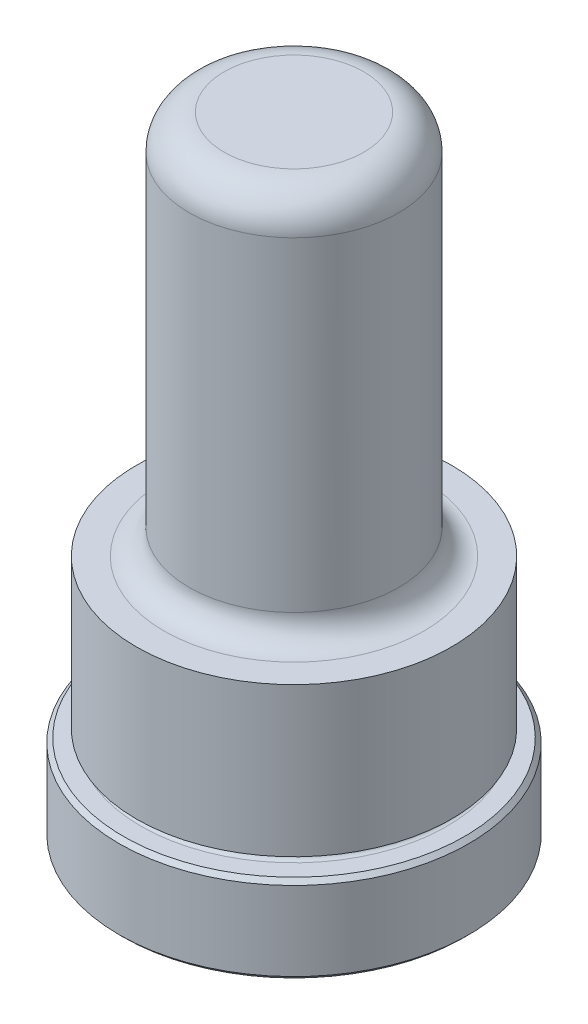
ISO-10303-21;
HEADER;
FILE_DESCRIPTION(('STEP AP214'),'2;1');
FILE_NAME('part.step','',(''),(''),'','','');
FILE_SCHEMA(('AUTOMOTIVE_DESIGN { 1 0 10303 214 1 1 1 1 }'));
ENDSEC;
DATA;
#1=APPLICATION_CONTEXT('core data for automotive mechanical design processes');
#2=APPLICATION_PROTOCOL_DEFINITION('international standard','automotive_design',2000,#1);
#3=PRODUCT_CONTEXT('',#1,'mechanical');
#4=PRODUCT('Part','Part','',(#3));
#5=PRODUCT_RELATED_PRODUCT_CATEGORY('part','',(#4));
#6=PRODUCT_DEFINITION_FORMATION('','',#4);
#7=PRODUCT_DEFINITION_CONTEXT('part definition',#1,'design');
#8=PRODUCT_DEFINITION('design','',#6,#7);
#9=PRODUCT_DEFINITION_SHAPE('','',#8);
#10=(LENGTH_UNIT() NAMED_UNIT(*) SI_UNIT(.MILLI.,.METRE.));
#11=(NAMED_UNIT(*) PLANE_ANGLE_UNIT() SI_UNIT($,.RADIAN.));
#12=(NAMED_UNIT(*) SI_UNIT($,.STERADIAN.) SOLID_ANGLE_UNIT());
#13=UNCERTAINTY_MEASURE_WITH_UNIT(LENGTH_MEASURE(1.E-05),#10,'distance_accuracy_value','');
#14=(GEOMETRIC_REPRESENTATION_CONTEXT(3) GLOBAL_UNCERTAINTY_ASSIGNED_CONTEXT((#13)) GLOBAL_UNIT_ASSIGNED_CONTEXT((#10,
#11,#12)) REPRESENTATION_CONTEXT('',''));
#15=CARTESIAN_POINT('',(0.,0.,0.));
#16=DIRECTION('',(0.,0.,1.));
#17=DIRECTION('',(1.,0.,0.));
#18=AXIS2_PLACEMENT_3D('',#15,#16,#17);
#19=CARTESIAN_POINT('',(0.,0.,0.));
#20=DIRECTION('',(0.,1.,0.));
#21=DIRECTION('',(0.,0.,1.));
#22=AXIS2_PLACEMENT_3D('',#19,#20,#21);
#23=PLANE('',#22);
#24=CARTESIAN_POINT('',(0.,0.,0.));
#25=DIRECTION('',(0.,1.,0.));
#26=DIRECTION('',(0.,0.,1.));
#27=AXIS2_PLACEMENT_3D('',#24,#25,#26);
#28=CIRCLE('',#27,15.494);
#29=CARTESIAN_POINT('',(0.,0.,15.494));
#30=VERTEX_POINT('',#29);
#31=EDGE_CURVE('E46',#30,#30,#28,.F.);
#32=ORIENTED_EDGE('',*,*,#31,.T.);
#33=EDGE_LOOP('',(#32));
#34=FACE_BOUND('',#33,.T.);
#35=ADVANCED_FACE('F31',(#34),#23,.F.);
#36=CARTESIAN_POINT('',(0.,0.,0.));
#37=DIRECTION('',(0.,1.,0.));
#38=DIRECTION('',(0.,0.,1.));
#39=AXIS2_PLACEMENT_3D('',#36,#37,#38);
#40=CYLINDRICAL_SURFACE('',#39,15.875);
#41=CARTESIAN_POINT('',(0.,0.381000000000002,0.));
#42=DIRECTION('',(0.,1.,0.));
#43=DIRECTION('',(0.,0.,1.));
#44=AXIS2_PLACEMENT_3D('',#41,#42,#43);
#45=CIRCLE('',#44,15.875);
#46=CARTESIAN_POINT('',(0.,0.381,15.875));
#47=VERTEX_POINT('',#46);
#48=EDGE_CURVE('E51',#47,#47,#45,.T.);
#49=ORIENTED_EDGE('',*,*,#48,.T.);
#50=EDGE_LOOP('',(#49));
#51=FACE_BOUND('',#50,.T.);
#52=CARTESIAN_POINT('',(0.,7.5438,0.));
#53=DIRECTION('',(0.,-1.,0.));
#54=DIRECTION('',(0.,0.,-1.));
#55=AXIS2_PLACEMENT_3D('',#52,#53,#54);
#56=CIRCLE('',#55,15.875);
#57=CARTESIAN_POINT('',(0.,7.5438,-15.875));
#58=VERTEX_POINT('',#57);
#59=EDGE_CURVE('E54',#58,#58,#56,.T.);
#60=ORIENTED_EDGE('',*,*,#59,.T.);
#61=EDGE_LOOP('',(#60));
#62=FACE_BOUND('',#61,.T.);
#63=ADVANCED_FACE('F110',(#51,#62),#40,.T.);
#64=CARTESIAN_POINT('',(0.,7.9248,-15.875));
#65=DIRECTION('',(0.,-1.,0.));
#66=DIRECTION('',(0.,0.,-1.));
#67=AXIS2_PLACEMENT_3D('',#64,#65,#66);
#68=PLANE('',#67);
#69=CARTESIAN_POINT('',(0.,7.9248,0.));
#70=DIRECTION('',(0.,-1.,0.));
#71=DIRECTION('',(0.,0.,-1.));
#72=AXIS2_PLACEMENT_3D('',#69,#70,#71);
#73=CIRCLE('',#72,15.494);
#74=CARTESIAN_POINT('',(0.,7.9248,-15.494));
#75=VERTEX_POINT('',#74);
#76=EDGE_CURVE('E42',#75,#75,#73,.F.);
#77=ORIENTED_EDGE('',*,*,#76,.T.);
#78=EDGE_LOOP('',(#77));
#79=FACE_BOUND('',#78,.T.);
#80=CARTESIAN_POINT('',(0.,7.9248,0.));
#81=DIRECTION('',(0.,1.,0.));
#82=DIRECTION('',(0.,0.,1.));
#83=AXIS2_PLACEMENT_3D('',#80,#81,#82);
#84=CIRCLE('',#83,13.8938);
#85=CARTESIAN_POINT('',(0.,7.9248,13.8938));
#86=VERTEX_POINT('',#85);
#87=EDGE_CURVE('E57',#86,#86,#84,.T.);
#88=ORIENTED_EDGE('',*,*,#87,.F.);
#89=EDGE_LOOP('',(#88));
#90=FACE_BOUND('',#89,.T.);
#91=ADVANCED_FACE('F105',(#79,#90),#68,.F.);
#92=CARTESIAN_POINT('',(0.,8.3058,0.));
#93=DIRECTION('',(0.,1.,0.));
#94=DIRECTION('',(0.,0.,1.));
#95=AXIS2_PLACEMENT_3D('',#92,#93,#94);
#96=TOROIDAL_SURFACE('',#95,13.8938,0.381000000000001);
#97=CARTESIAN_POINT('',(0.,8.68680000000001,0.));
#98=DIRECTION('',(0.,1.,0.));
#99=DIRECTION('',(0.,0.,1.));
#100=AXIS2_PLACEMENT_3D('',#97,#98,#99);
#101=CIRCLE('',#100,13.8938);
#102=CARTESIAN_POINT('',(0.,8.6868,13.8938));
#103=VERTEX_POINT('',#102);
#104=EDGE_CURVE('E60',#103,#103,#101,.T.);
#105=ORIENTED_EDGE('',*,*,#104,.F.);
#106=EDGE_LOOP('',(#105));
#107=FACE_BOUND('',#106,.T.);
#108=ORIENTED_EDGE('',*,*,#87,.T.);
#109=EDGE_LOOP('',(#108));
#110=FACE_BOUND('',#109,.T.);
#111=ADVANCED_FACE('F99',(#107,#110),#96,.F.);
#112=CARTESIAN_POINT('',(0.,8.68680000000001,-13.8938));
#113=DIRECTION('',(0.,1.,0.));
#114=DIRECTION('',(0.,0.,1.));
#115=AXIS2_PLACEMENT_3D('',#112,#113,#114);
#116=PLANE('',#115);
#117=CARTESIAN_POINT('',(0.,8.6868,0.));
#118=DIRECTION('',(0.,1.,0.));
#119=DIRECTION('',(0.,0.,1.));
#120=AXIS2_PLACEMENT_3D('',#117,#118,#119);
#121=CIRCLE('',#120,14.3002);
#122=CARTESIAN_POINT('',(0.,8.6868,14.3002));
#123=VERTEX_POINT('',#122);
#124=EDGE_CURVE('E63',#123,#123,#121,.T.);
#125=ORIENTED_EDGE('',*,*,#124,.F.);
#126=EDGE_LOOP('',(#125));
#127=FACE_BOUND('',#126,.T.);
#128=ORIENTED_EDGE('',*,*,#104,.T.);
#129=EDGE_LOOP('',(#128));
#130=FACE_BOUND('',#129,.T.);
#131=ADVANCED_FACE('F93',(#127,#130),#116,.F.);
#132=CARTESIAN_POINT('',(0.,0.,0.));
#133=DIRECTION('',(0.,1.,0.));
#134=DIRECTION('',(0.,0.,1.));
#135=AXIS2_PLACEMENT_3D('',#132,#133,#134);
#136=CYLINDRICAL_SURFACE('',#135,14.3002);
#137=CARTESIAN_POINT('',(0.,22.225,0.));
#138=DIRECTION('',(0.,1.,0.));
#139=DIRECTION('',(0.,0.,1.));
#140=AXIS2_PLACEMENT_3D('',#137,#138,#139);
#141=CIRCLE('',#140,14.3002);
#142=CARTESIAN_POINT('',(0.,22.225,14.3002));
#143=VERTEX_POINT('',#142);
#144=EDGE_CURVE('E66',#143,#143,#141,.T.);
#145=ORIENTED_EDGE('',*,*,#144,.F.);
#146=EDGE_LOOP('',(#145));
#147=FACE_BOUND('',#146,.T.);
#148=ORIENTED_EDGE('',*,*,#124,.T.);
#149=EDGE_LOOP('',(#148));
#150=FACE_BOUND('',#149,.T.);
#151=ADVANCED_FACE('F87',(#147,#150),#136,.T.);
#152=CARTESIAN_POINT('',(0.,22.225,-14.3002));
#153=DIRECTION('',(0.,-1.,0.));
#154=DIRECTION('',(0.,0.,-1.));
#155=AXIS2_PLACEMENT_3D('',#152,#153,#154);
#156=PLANE('',#155);
#157=CARTESIAN_POINT('',(0.,22.225,0.));
#158=DIRECTION('',(0.,1.,0.));
#159=DIRECTION('',(0.,0.,1.));
#160=AXIS2_PLACEMENT_3D('',#157,#158,#159);
#161=CIRCLE('',#160,11.7983);
#162=CARTESIAN_POINT('',(0.,22.225,11.7983));
#163=VERTEX_POINT('',#162);
#164=EDGE_CURVE('E69',#163,#163,#161,.T.);
#165=ORIENTED_EDGE('',*,*,#164,.F.);
#166=EDGE_LOOP('',(#165));
#167=FACE_BOUND('',#166,.T.);
#168=ORIENTED_EDGE('',*,*,#144,.T.);
#169=EDGE_LOOP('',(#168));
#170=FACE_BOUND('',#169,.T.);
#171=ADVANCED_FACE('F81',(#167,#170),#156,.F.);
#172=CARTESIAN_POINT('',(0.,24.511,0.));
#173=DIRECTION('',(0.,1.,0.));
#174=DIRECTION('',(0.,0.,1.));
#175=AXIS2_PLACEMENT_3D('',#172,#173,#174);
#176=TOROIDAL_SURFACE('',#175,11.7983,2.286);
#177=CARTESIAN_POINT('',(0.,24.511,0.));
#178=DIRECTION('',(0.,1.,0.));
#179=DIRECTION('',(0.,0.,1.));
#180=AXIS2_PLACEMENT_3D('',#177,#178,#179);
#181=CIRCLE('',#180,9.51229999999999);
#182=CARTESIAN_POINT('',(0.,24.511,9.5123));
#183=VERTEX_POINT('',#182);
#184=EDGE_CURVE('E72',#183,#183,#181,.T.);
#185=ORIENTED_EDGE('',*,*,#184,.F.);
#186=EDGE_LOOP('',(#185));
#187=FACE_BOUND('',#186,.T.);
#188=ORIENTED_EDGE('',*,*,#164,.T.);
#189=EDGE_LOOP('',(#188));
#190=FACE_BOUND('',#189,.T.);
#191=ADVANCED_FACE('F78',(#187,#190),#176,.F.);
#192=CARTESIAN_POINT('',(0.,0.,0.));
#193=DIRECTION('',(0.,1.,0.));
#194=DIRECTION('',(0.,0.,1.));
#195=AXIS2_PLACEMENT_3D('',#192,#193,#194);
#196=CYLINDRICAL_SURFACE('',#195,9.5123);
#197=CARTESIAN_POINT('',(0.,53.975,0.));
#198=DIRECTION('',(0.,-1.,0.));
#199=DIRECTION('',(0.,0.,-1.));
#200=AXIS2_PLACEMENT_3D('',#197,#198,#199);
#201=CIRCLE('',#200,9.5123);
#202=CARTESIAN_POINT('',(0.,53.975,-9.51229999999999));
#203=VERTEX_POINT('',#202);
#204=EDGE_CURVE('E10',#203,#203,#201,.T.);
#205=ORIENTED_EDGE('',*,*,#204,.T.);
#206=EDGE_LOOP('',(#205));
#207=FACE_BOUND('',#206,.T.);
#208=ORIENTED_EDGE('',*,*,#184,.T.);
#209=EDGE_LOOP('',(#208));
#210=FACE_BOUND('',#209,.T.);
#211=ADVANCED_FACE('F76',(#207,#210),#196,.T.);
#212=CARTESIAN_POINT('',(0.,57.15,-9.5123));
#213=DIRECTION('',(0.,-1.,0.));
#214=DIRECTION('',(0.,0.,-1.));
#215=AXIS2_PLACEMENT_3D('',#212,#213,#214);
#216=PLANE('',#215);
#217=CARTESIAN_POINT('',(0.,57.15,0.));
#218=DIRECTION('',(0.,-1.,0.));
#219=DIRECTION('',(0.,0.,-1.));
#220=AXIS2_PLACEMENT_3D('',#217,#218,#219);
#221=CIRCLE('',#220,6.3373);
#222=CARTESIAN_POINT('',(0.,57.15,-6.33729999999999));
#223=VERTEX_POINT('',#222);
#224=EDGE_CURVE('E38',#223,#223,#221,.F.);
#225=ORIENTED_EDGE('',*,*,#224,.T.);
#226=EDGE_LOOP('',(#225));
#227=FACE_BOUND('',#226,.T.);
#228=ADVANCED_FACE('F127',(#227),#216,.F.);
#229=CARTESIAN_POINT('',(0.,0.381000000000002,0.));
#230=DIRECTION('',(0.,1.,0.));
#231=DIRECTION('',(0.,0.,1.));
#232=AXIS2_PLACEMENT_3D('',#229,#230,#231);
#233=CONICAL_SURFACE('',#232,15.875,0.785398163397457);
#234=ORIENTED_EDGE('',*,*,#31,.F.);
#235=EDGE_LOOP('',(#234));
#236=FACE_BOUND('',#235,.T.);
#237=ORIENTED_EDGE('',*,*,#48,.F.);
#238=EDGE_LOOP('',(#237));
#239=FACE_BOUND('',#238,.T.);
#240=ADVANCED_FACE('F124',(#236,#239),#233,.T.);
#241=CARTESIAN_POINT('',(0.,7.9248,0.));
#242=DIRECTION('',(0.,-1.,0.));
#243=DIRECTION('',(0.,0.,-1.));
#244=AXIS2_PLACEMENT_3D('',#241,#242,#243);
#245=CONICAL_SURFACE('',#244,15.494,0.785398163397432);
#246=ORIENTED_EDGE('',*,*,#59,.F.);
#247=EDGE_LOOP('',(#246));
#248=FACE_BOUND('',#247,.T.);
#249=ORIENTED_EDGE('',*,*,#76,.F.);
#250=EDGE_LOOP('',(#249));
#251=FACE_BOUND('',#250,.T.);
#252=ADVANCED_FACE('F126',(#248,#251),#245,.T.);
#253=CARTESIAN_POINT('',(0.,53.975,0.));
#254=DIRECTION('',(0.,-1.,0.));
#255=DIRECTION('',(0.,0.,-1.));
#256=AXIS2_PLACEMENT_3D('',#253,#254,#255);
#257=TOROIDAL_SURFACE('',#256,6.3373,3.175);
#258=ORIENTED_EDGE('',*,*,#204,.F.);
#259=EDGE_LOOP('',(#258));
#260=FACE_BOUND('',#259,.T.);
#261=ORIENTED_EDGE('',*,*,#224,.F.);
#262=EDGE_LOOP('',(#261));
#263=FACE_BOUND('',#262,.T.);
#264=ADVANCED_FACE('F33',(#260,#263),#257,.T.);
#265=CLOSED_SHELL('',(#35,#63,#91,#111,#131,#151,#171,#191,#211,#228,#240,#252,#264));
#266=MANIFOLD_SOLID_BREP('B2',#265);
#267=ADVANCED_BREP_SHAPE_REPRESENTATION('',(#18,#266),#14);
#268=SHAPE_DEFINITION_REPRESENTATION(#9,#267);
ENDSEC;
END-ISO-10303-21;
